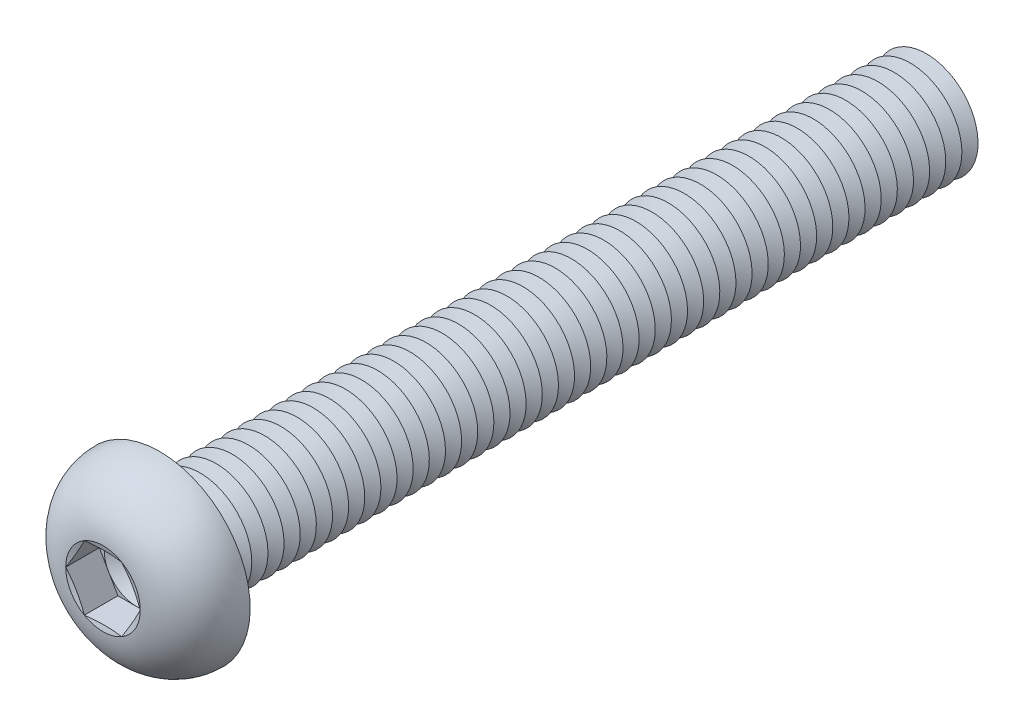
from build123d import *

# Parameters (mm, degrees)
FILLET1_R          = 0.625
LPATTERN1_COUNT    = 48
LPATTERN1_PITCH    = 1.25
CUT_EXTRUDE1_DEPTH = 2.6


with BuildPart() as part:
    # Sketch1 → Revolve1 (revolve)
    with BuildSketch(Plane(origin=(0, 0, 0), x_dir=(0, 0, -1), z_dir=(1, 0, 0))):
        with BuildLine():
            Line((0, 4), (0, 7))
            ThreePointArc((0, 7), (-3.011595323, 5.81154966), (-4.4, 2.88675))
            Line((-4.4, 2.88675), (-4.013248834, 1.443375))
            Line((-4.013248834, 1.443375), (-4.4, 1.443375))
            Line((-4.4, 1.443375), (-4.4, 0))
            Line((-4.4, 0), (60, 0))
            Line((60, 0), (60, 4))
            Line((60, 4), (0, 4))
        make_face()
    revolve(axis=Axis((0, 0, -60), (0, 0, 1)))

    # Fillet1
    fillet1_edges = [part.edges().sort_by_distance(p)[0] for p in [
        (0, -4, 0),
    ]]
    fillet(fillet1_edges, radius=FILLET1_R)

    # Sketch2 → Cut-Revolve1 (revolve, cut)
    with BuildSketch(Plane(origin=(0, 0, 0), x_dir=(0, 0, -1), z_dir=(1, 0, 0))):
        Polygon((59.375, 4), (60.625, 4), (60, 2.917468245), align=None)
    cut_revolve1 = revolve(axis=Axis((0, 0, -60), (0, 0, -1)), mode=Mode.SUBTRACT)

    # LPattern1: Cut-Revolve1 ×48
    with Locations(*[(0, 0, i * LPATTERN1_PITCH) for i in range(1, LPATTERN1_COUNT)]):
        add(cut_revolve1, mode=Mode.SUBTRACT)

    # Sketch3 → Cut-Extrude1 (cut)
    with BuildSketch(Plane.XY.offset(4.4)):
        Polygon((1.443375, 2.499998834), (-1.443375, 2.499998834), (-2.88675, 0), (-1.443375, -2.499998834), (1.443375, -2.499998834), (2.88675, 0), align=None)
    extrude(amount=-CUT_EXTRUDE1_DEPTH, mode=Mode.SUBTRACT)

    # Cut-Extrude2 cone 1 section (on through the dimple's axis) → Cut-Extrude2 (revolve, cut)
    with BuildSketch(Plane(origin=(0, 0, 1.8), x_dir=(0, -1, 0), z_dir=(1, 0, 0))):
        Polygon((0, 0), (2.499998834, 0), (0, 1.443375), align=None)
    revolve(axis=Axis((0, 0, 1.8), (0, 0, -1)), mode=Mode.SUBTRACT)


solid = part.part
